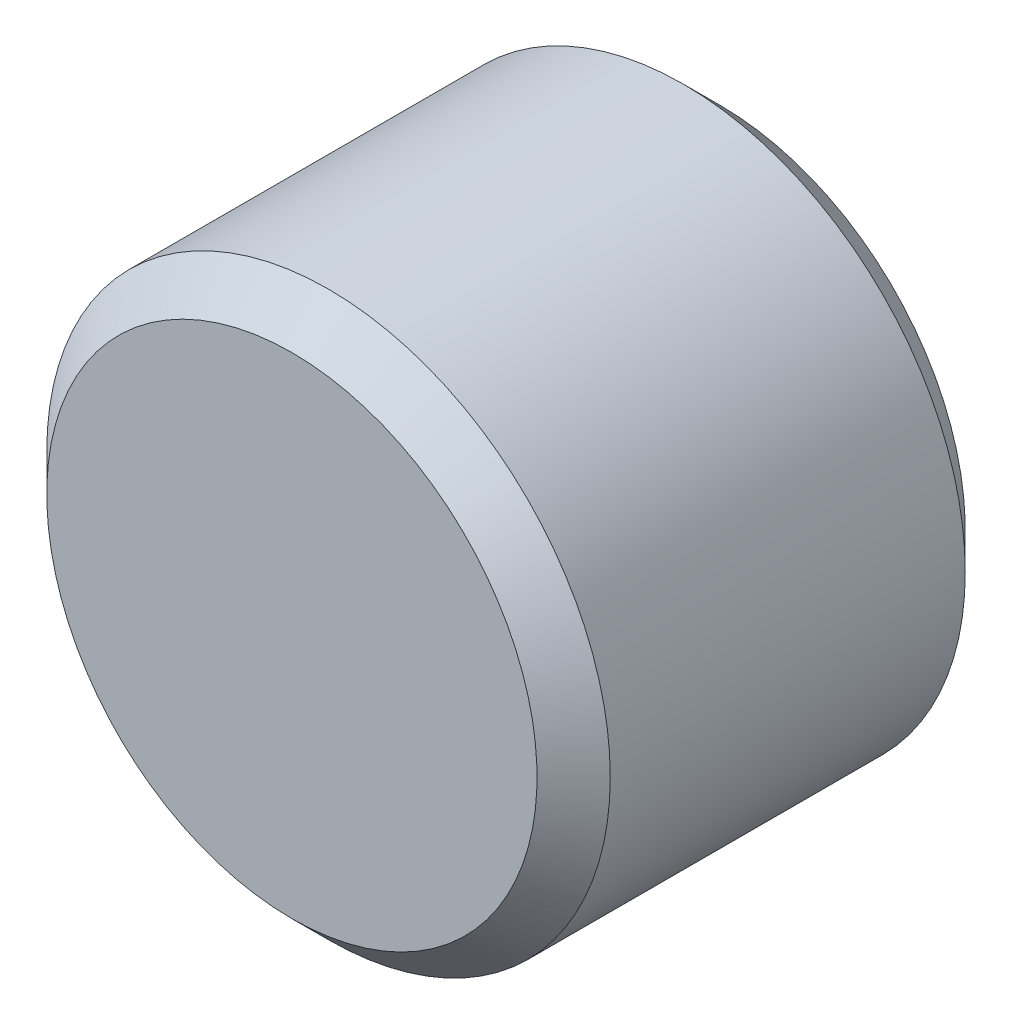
ISO-10303-21;
HEADER;
FILE_DESCRIPTION(('STEP AP214'),'2;1');
FILE_NAME('part.step','',(''),(''),'','','');
FILE_SCHEMA(('AUTOMOTIVE_DESIGN { 1 0 10303 214 1 1 1 1 }'));
ENDSEC;
DATA;
#1=APPLICATION_CONTEXT('core data for automotive mechanical design processes');
#2=APPLICATION_PROTOCOL_DEFINITION('international standard','automotive_design',2000,#1);
#3=PRODUCT_CONTEXT('',#1,'mechanical');
#4=PRODUCT('Part','Part','',(#3));
#5=PRODUCT_RELATED_PRODUCT_CATEGORY('part','',(#4));
#6=PRODUCT_DEFINITION_FORMATION('','',#4);
#7=PRODUCT_DEFINITION_CONTEXT('part definition',#1,'design');
#8=PRODUCT_DEFINITION('design','',#6,#7);
#9=PRODUCT_DEFINITION_SHAPE('','',#8);
#10=(LENGTH_UNIT() NAMED_UNIT(*) SI_UNIT(.MILLI.,.METRE.));
#11=(NAMED_UNIT(*) PLANE_ANGLE_UNIT() SI_UNIT($,.RADIAN.));
#12=(NAMED_UNIT(*) SI_UNIT($,.STERADIAN.) SOLID_ANGLE_UNIT());
#13=UNCERTAINTY_MEASURE_WITH_UNIT(LENGTH_MEASURE(1.E-05),#10,'distance_accuracy_value','');
#14=(GEOMETRIC_REPRESENTATION_CONTEXT(3) GLOBAL_UNCERTAINTY_ASSIGNED_CONTEXT((#13)) GLOBAL_UNIT_ASSIGNED_CONTEXT((#10,
#11,#12)) REPRESENTATION_CONTEXT('',''));
#15=CARTESIAN_POINT('',(0.,0.,0.));
#16=DIRECTION('',(0.,0.,1.));
#17=DIRECTION('',(1.,0.,0.));
#18=AXIS2_PLACEMENT_3D('',#15,#16,#17);
#19=CARTESIAN_POINT('',(0.,3.5,0.));
#20=DIRECTION('',(0.,0.,1.));
#21=DIRECTION('',(0.,-1.,0.));
#22=AXIS2_PLACEMENT_3D('',#19,#20,#21);
#23=PLANE('',#22);
#24=CARTESIAN_POINT('',(0.,0.,0.));
#25=DIRECTION('',(0.,0.,1.));
#26=DIRECTION('',(0.,-1.,0.));
#27=AXIS2_PLACEMENT_3D('',#24,#25,#26);
#28=CIRCLE('',#27,5.71500000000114);
#29=CARTESIAN_POINT('',(0.,-5.71500000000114,0.));
#30=VERTEX_POINT('',#29);
#31=EDGE_CURVE('E150',#30,#30,#28,.T.);
#32=ORIENTED_EDGE('',*,*,#31,.F.);
#33=EDGE_LOOP('',(#32));
#34=FACE_BOUND('',#33,.T.);
#35=DIRECTION('',(0.5,-0.866025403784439,0.));
#36=VECTOR('',#35,1.);
#37=CARTESIAN_POINT('',(1.51554445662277,4.375,0.));
#38=LINE('',#37,#36);
#39=CARTESIAN_POINT('',(2.02072594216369,3.5,0.));
#40=VERTEX_POINT('',#39);
#41=CARTESIAN_POINT('',(4.04145188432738,0.,0.));
#42=VERTEX_POINT('',#41);
#43=EDGE_CURVE('E11',#40,#42,#38,.T.);
#44=ORIENTED_EDGE('',*,*,#43,.F.);
#45=DIRECTION('',(1.,0.,0.));
#46=VECTOR('',#45,1.);
#47=CARTESIAN_POINT('',(0.,3.5,0.));
#48=LINE('',#47,#46);
#49=CARTESIAN_POINT('',(-2.02072594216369,3.5,0.));
#50=VERTEX_POINT('',#49);
#51=EDGE_CURVE('E162',#50,#40,#48,.T.);
#52=ORIENTED_EDGE('',*,*,#51,.F.);
#53=DIRECTION('',(0.5,0.866025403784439,0.));
#54=VECTOR('',#53,1.);
#55=CARTESIAN_POINT('',(-1.51554445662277,4.375,0.));
#56=LINE('',#55,#54);
#57=CARTESIAN_POINT('',(-4.04145188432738,0.,0.));
#58=VERTEX_POINT('',#57);
#59=EDGE_CURVE('E158',#58,#50,#56,.T.);
#60=ORIENTED_EDGE('',*,*,#59,.F.);
#61=DIRECTION('',(-0.5,0.866025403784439,0.));
#62=VECTOR('',#61,1.);
#63=CARTESIAN_POINT('',(-4.54663336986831,0.874999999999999,0.));
#64=LINE('',#63,#62);
#65=CARTESIAN_POINT('',(-2.02072594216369,-3.5,0.));
#66=VERTEX_POINT('',#65);
#67=EDGE_CURVE('E155',#66,#58,#64,.T.);
#68=ORIENTED_EDGE('',*,*,#67,.F.);
#69=DIRECTION('',(-1.,0.,0.));
#70=VECTOR('',#69,1.);
#71=CARTESIAN_POINT('',(0.,-3.5,0.));
#72=LINE('',#71,#70);
#73=CARTESIAN_POINT('',(2.02072594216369,-3.5,0.));
#74=VERTEX_POINT('',#73);
#75=EDGE_CURVE('E160',#74,#66,#72,.T.);
#76=ORIENTED_EDGE('',*,*,#75,.F.);
#77=DIRECTION('',(-0.5,-0.866025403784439,0.));
#78=VECTOR('',#77,1.);
#79=CARTESIAN_POINT('',(4.54663336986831,0.874999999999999,0.));
#80=LINE('',#79,#78);
#81=EDGE_CURVE('E42',#42,#74,#80,.T.);
#82=ORIENTED_EDGE('',*,*,#81,.F.);
#83=EDGE_LOOP('',(#44,#52,#60,#68,#76,#82));
#84=FACE_BOUND('',#83,.T.);
#85=ADVANCED_FACE('F34',(#34,#84),#23,.F.);
#86=CARTESIAN_POINT('',(0.,0.,10.));
#87=DIRECTION('',(0.,0.,-1.));
#88=DIRECTION('',(0.,1.,0.));
#89=AXIS2_PLACEMENT_3D('',#86,#87,#88);
#90=PLANE('',#89);
#91=CARTESIAN_POINT('',(0.,0.,10.));
#92=DIRECTION('',(0.,0.,1.));
#93=DIRECTION('',(0.,-1.,0.));
#94=AXIS2_PLACEMENT_3D('',#91,#92,#93);
#95=CIRCLE('',#94,5.725);
#96=CARTESIAN_POINT('',(0.,-5.725,10.));
#97=VERTEX_POINT('',#96);
#98=EDGE_CURVE('E126',#97,#97,#95,.T.);
#99=ORIENTED_EDGE('',*,*,#98,.T.);
#100=EDGE_LOOP('',(#99));
#101=FACE_BOUND('',#100,.T.);
#102=ADVANCED_FACE('F36',(#101),#90,.F.);
#103=CARTESIAN_POINT('',(0.,0.,10.));
#104=DIRECTION('',(0.,0.,1.));
#105=DIRECTION('',(0.,-1.,0.));
#106=AXIS2_PLACEMENT_3D('',#103,#104,#105);
#107=CYLINDRICAL_SURFACE('',#106,5.71500000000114);
#108=CARTESIAN_POINT('',(0.,0.,9.99000000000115));
#109=DIRECTION('',(0.,0.,1.));
#110=DIRECTION('',(0.,-1.,0.));
#111=AXIS2_PLACEMENT_3D('',#108,#109,#110);
#112=CIRCLE('',#111,5.71500000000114);
#113=CARTESIAN_POINT('',(0.,-5.71500000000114,9.99000000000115));
#114=VERTEX_POINT('',#113);
#115=EDGE_CURVE('E147',#114,#114,#112,.T.);
#116=ORIENTED_EDGE('',*,*,#115,.F.);
#117=EDGE_LOOP('',(#116));
#118=FACE_BOUND('',#117,.T.);
#119=ORIENTED_EDGE('',*,*,#31,.T.);
#120=EDGE_LOOP('',(#119));
#121=FACE_BOUND('',#120,.T.);
#122=ADVANCED_FACE('F245',(#118,#121),#107,.T.);
#123=CARTESIAN_POINT('',(0.,5.72499999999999,9.99000000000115));
#124=DIRECTION('',(0.,0.,1.));
#125=DIRECTION('',(0.,-1.,0.));
#126=AXIS2_PLACEMENT_3D('',#123,#124,#125);
#127=PLANE('',#126);
#128=CARTESIAN_POINT('',(0.,0.,9.99000000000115));
#129=DIRECTION('',(0.,0.,1.));
#130=DIRECTION('',(0.,-1.,0.));
#131=AXIS2_PLACEMENT_3D('',#128,#129,#130);
#132=CIRCLE('',#131,5.72499999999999);
#133=CARTESIAN_POINT('',(0.,-5.72499999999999,9.99000000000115));
#134=VERTEX_POINT('',#133);
#135=EDGE_CURVE('E144',#134,#134,#132,.T.);
#136=ORIENTED_EDGE('',*,*,#135,.F.);
#137=EDGE_LOOP('',(#136));
#138=FACE_BOUND('',#137,.T.);
#139=ORIENTED_EDGE('',*,*,#115,.T.);
#140=EDGE_LOOP('',(#139));
#141=FACE_BOUND('',#140,.T.);
#142=ADVANCED_FACE('F281',(#138,#141),#127,.F.);
#143=CARTESIAN_POINT('',(0.,0.,10.));
#144=DIRECTION('',(0.,0.,1.));
#145=DIRECTION('',(0.,-1.,0.));
#146=AXIS2_PLACEMENT_3D('',#143,#144,#145);
#147=CYLINDRICAL_SURFACE('',#146,5.725);
#148=CARTESIAN_POINT('',(0.,0.,0.));
#149=DIRECTION('',(0.,0.,1.));
#150=DIRECTION('',(0.,-1.,0.));
#151=AXIS2_PLACEMENT_3D('',#148,#149,#150);
#152=CIRCLE('',#151,5.725);
#153=CARTESIAN_POINT('',(0.,-5.725,0.));
#154=VERTEX_POINT('',#153);
#155=EDGE_CURVE('E141',#154,#154,#152,.T.);
#156=ORIENTED_EDGE('',*,*,#155,.F.);
#157=EDGE_LOOP('',(#156));
#158=FACE_BOUND('',#157,.T.);
#159=ORIENTED_EDGE('',*,*,#135,.T.);
#160=EDGE_LOOP('',(#159));
#161=FACE_BOUND('',#160,.T.);
#162=ADVANCED_FACE('F278',(#158,#161),#147,.F.);
#163=CARTESIAN_POINT('',(0.,0.,0.));
#164=DIRECTION('',(0.,0.,1.));
#165=DIRECTION('',(0.,-1.,0.));
#166=AXIS2_PLACEMENT_3D('',#163,#164,#165);
#167=CONICAL_SURFACE('',#166,5.725,0.785398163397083);
#168=CARTESIAN_POINT('',(0.,0.,0.855000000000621));
#169=DIRECTION('',(0.,0.,1.));
#170=DIRECTION('',(0.,-1.,0.));
#171=AXIS2_PLACEMENT_3D('',#168,#169,#170);
#172=CIRCLE('',#171,6.58);
#173=CARTESIAN_POINT('',(0.,-6.58,0.855000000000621));
#174=VERTEX_POINT('',#173);
#175=EDGE_CURVE('E138',#174,#174,#172,.T.);
#176=ORIENTED_EDGE('',*,*,#175,.F.);
#177=EDGE_LOOP('',(#176));
#178=FACE_BOUND('',#177,.T.);
#179=ORIENTED_EDGE('',*,*,#155,.T.);
#180=EDGE_LOOP('',(#179));
#181=FACE_BOUND('',#180,.T.);
#182=ADVANCED_FACE('F274',(#178,#181),#167,.T.);
#183=CARTESIAN_POINT('',(0.,0.,10.));
#184=DIRECTION('',(0.,0.,1.));
#185=DIRECTION('',(0.,-1.,0.));
#186=AXIS2_PLACEMENT_3D('',#183,#184,#185);
#187=CYLINDRICAL_SURFACE('',#186,6.58);
#188=CARTESIAN_POINT('',(0.,0.,9.14500000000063));
#189=DIRECTION('',(0.,0.,1.));
#190=DIRECTION('',(0.,-1.,0.));
#191=AXIS2_PLACEMENT_3D('',#188,#189,#190);
#192=CIRCLE('',#191,6.58);
#193=CARTESIAN_POINT('',(0.,-6.58,9.14500000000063));
#194=VERTEX_POINT('',#193);
#195=EDGE_CURVE('E130',#194,#194,#192,.T.);
#196=ORIENTED_EDGE('',*,*,#195,.F.);
#197=EDGE_LOOP('',(#196));
#198=FACE_BOUND('',#197,.T.);
#199=ORIENTED_EDGE('',*,*,#175,.T.);
#200=EDGE_LOOP('',(#199));
#201=FACE_BOUND('',#200,.T.);
#202=ADVANCED_FACE('F270',(#198,#201),#187,.T.);
#203=CARTESIAN_POINT('',(0.,0.,9.14500000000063));
#204=DIRECTION('',(0.,0.,-1.));
#205=DIRECTION('',(0.,1.,0.));
#206=AXIS2_PLACEMENT_3D('',#203,#204,#205);
#207=CONICAL_SURFACE('',#206,6.58,0.785398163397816);
#208=ORIENTED_EDGE('',*,*,#98,.F.);
#209=EDGE_LOOP('',(#208));
#210=FACE_BOUND('',#209,.T.);
#211=ORIENTED_EDGE('',*,*,#195,.T.);
#212=EDGE_LOOP('',(#211));
#213=FACE_BOUND('',#212,.T.);
#214=ADVANCED_FACE('F267',(#210,#213),#207,.T.);
#215=CARTESIAN_POINT('',(0.,0.,6.));
#216=DIRECTION('',(0.,0.,1.));
#217=DIRECTION('',(1.,0.,0.));
#218=AXIS2_PLACEMENT_3D('',#215,#216,#217);
#219=PLANE('',#218);
#220=DIRECTION('',(0.5,0.866025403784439,0.));
#221=VECTOR('',#220,1.);
#222=CARTESIAN_POINT('',(2.02072594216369,-3.5,6.));
#223=LINE('',#222,#221);
#224=CARTESIAN_POINT('',(2.02072594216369,-3.5,6.));
#225=VERTEX_POINT('',#224);
#226=CARTESIAN_POINT('',(3.03108891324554,-1.75,6.));
#227=VERTEX_POINT('',#226);
#228=EDGE_CURVE('E49',#225,#227,#223,.T.);
#229=ORIENTED_EDGE('',*,*,#228,.F.);
#230=DIRECTION('',(1.,0.,0.));
#231=VECTOR('',#230,1.);
#232=CARTESIAN_POINT('',(-2.02072594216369,-3.5,6.));
#233=LINE('',#232,#231);
#234=CARTESIAN_POINT('',(0.,-3.5,6.));
#235=VERTEX_POINT('',#234);
#236=EDGE_CURVE('E106',#235,#225,#233,.T.);
#237=ORIENTED_EDGE('',*,*,#236,.F.);
#238=CARTESIAN_POINT('',(0.,0.,6.));
#239=DIRECTION('',(0.,0.,1.));
#240=DIRECTION('',(0.,-1.,0.));
#241=AXIS2_PLACEMENT_3D('',#238,#239,#240);
#242=CIRCLE('',#241,3.5);
#243=EDGE_CURVE('E118',#235,#227,#242,.T.);
#244=ORIENTED_EDGE('',*,*,#243,.T.);
#245=EDGE_LOOP('',(#229,#237,#244));
#246=FACE_BOUND('',#245,.T.);
#247=ADVANCED_FACE('F117',(#246),#219,.F.);
#248=CARTESIAN_POINT('',(-2.02072594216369,-3.5,6.));
#249=VERTEX_POINT('',#248);
#250=EDGE_CURVE('E112',#249,#235,#233,.T.);
#251=ORIENTED_EDGE('',*,*,#250,.F.);
#252=DIRECTION('',(0.5,-0.866025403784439,0.));
#253=VECTOR('',#252,1.);
#254=CARTESIAN_POINT('',(-4.04145188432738,0.,6.));
#255=LINE('',#254,#253);
#256=CARTESIAN_POINT('',(-3.03108891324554,-1.75,6.));
#257=VERTEX_POINT('',#256);
#258=EDGE_CURVE('E190',#257,#249,#255,.T.);
#259=ORIENTED_EDGE('',*,*,#258,.F.);
#260=EDGE_CURVE('E153',#257,#235,#242,.T.);
#261=ORIENTED_EDGE('',*,*,#260,.T.);
#262=EDGE_LOOP('',(#251,#259,#261));
#263=FACE_BOUND('',#262,.T.);
#264=ADVANCED_FACE('F227',(#263),#219,.F.);
#265=CARTESIAN_POINT('',(-4.04145188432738,0.,6.));
#266=VERTEX_POINT('',#265);
#267=EDGE_CURVE('E192',#266,#257,#255,.T.);
#268=ORIENTED_EDGE('',*,*,#267,.F.);
#269=DIRECTION('',(-0.5,-0.866025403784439,0.));
#270=VECTOR('',#269,1.);
#271=CARTESIAN_POINT('',(-2.02072594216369,3.5,6.));
#272=LINE('',#271,#270);
#273=CARTESIAN_POINT('',(-3.03108891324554,1.75,6.));
#274=VERTEX_POINT('',#273);
#275=EDGE_CURVE('E201',#274,#266,#272,.T.);
#276=ORIENTED_EDGE('',*,*,#275,.F.);
#277=EDGE_CURVE('E220',#274,#257,#242,.T.);
#278=ORIENTED_EDGE('',*,*,#277,.T.);
#279=EDGE_LOOP('',(#268,#276,#278));
#280=FACE_BOUND('',#279,.T.);
#281=ADVANCED_FACE('F228',(#280),#219,.F.);
#282=CARTESIAN_POINT('',(-2.02072594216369,3.5,6.));
#283=VERTEX_POINT('',#282);
#284=EDGE_CURVE('E198',#283,#274,#272,.T.);
#285=ORIENTED_EDGE('',*,*,#284,.F.);
#286=DIRECTION('',(-1.,0.,0.));
#287=VECTOR('',#286,1.);
#288=CARTESIAN_POINT('',(2.02072594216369,3.5,6.));
#289=LINE('',#288,#287);
#290=CARTESIAN_POINT('',(0.,3.5,6.));
#291=VERTEX_POINT('',#290);
#292=EDGE_CURVE('E204',#291,#283,#289,.T.);
#293=ORIENTED_EDGE('',*,*,#292,.F.);
#294=EDGE_CURVE('E217',#291,#274,#242,.T.);
#295=ORIENTED_EDGE('',*,*,#294,.T.);
#296=EDGE_LOOP('',(#285,#293,#295));
#297=FACE_BOUND('',#296,.T.);
#298=ADVANCED_FACE('F231',(#297),#219,.F.);
#299=CARTESIAN_POINT('',(2.02072594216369,3.5,6.));
#300=VERTEX_POINT('',#299);
#301=EDGE_CURVE('E202',#300,#291,#289,.T.);
#302=ORIENTED_EDGE('',*,*,#301,.F.);
#303=DIRECTION('',(-0.5,0.866025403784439,0.));
#304=VECTOR('',#303,1.);
#305=CARTESIAN_POINT('',(4.04145188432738,0.,6.));
#306=LINE('',#305,#304);
#307=CARTESIAN_POINT('',(3.03108891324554,1.75,6.));
#308=VERTEX_POINT('',#307);
#309=EDGE_CURVE('E120',#308,#300,#306,.T.);
#310=ORIENTED_EDGE('',*,*,#309,.F.);
#311=EDGE_CURVE('E211',#308,#291,#242,.T.);
#312=ORIENTED_EDGE('',*,*,#311,.T.);
#313=EDGE_LOOP('',(#302,#310,#312));
#314=FACE_BOUND('',#313,.T.);
#315=ADVANCED_FACE('F213',(#314),#219,.F.);
#316=CARTESIAN_POINT('',(4.04145188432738,0.,6.));
#317=VERTEX_POINT('',#316);
#318=EDGE_CURVE('E205',#317,#308,#306,.T.);
#319=ORIENTED_EDGE('',*,*,#318,.F.);
#320=EDGE_CURVE('E121',#227,#317,#223,.T.);
#321=ORIENTED_EDGE('',*,*,#320,.F.);
#322=EDGE_CURVE('E156',#227,#308,#242,.T.);
#323=ORIENTED_EDGE('',*,*,#322,.T.);
#324=EDGE_LOOP('',(#319,#321,#323));
#325=FACE_BOUND('',#324,.T.);
#326=ADVANCED_FACE('F209',(#325),#219,.F.);
#327=CARTESIAN_POINT('',(-2.02072594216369,-3.5,6.));
#328=DIRECTION('',(0.,1.,0.));
#329=DIRECTION('',(0.,0.,1.));
#330=AXIS2_PLACEMENT_3D('',#327,#328,#329);
#331=PLANE('',#330);
#332=ORIENTED_EDGE('',*,*,#250,.T.);
#333=ORIENTED_EDGE('',*,*,#236,.T.);
#334=DIRECTION('',(0.,0.,-1.));
#335=VECTOR('',#334,1.);
#336=CARTESIAN_POINT('',(2.02072594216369,-3.5,6.));
#337=LINE('',#336,#335);
#338=EDGE_CURVE('E108',#225,#74,#337,.T.);
#339=ORIENTED_EDGE('',*,*,#338,.T.);
#340=ORIENTED_EDGE('',*,*,#75,.T.);
#341=DIRECTION('',(0.,0.,-1.));
#342=VECTOR('',#341,1.);
#343=CARTESIAN_POINT('',(-2.02072594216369,-3.5,6.));
#344=LINE('',#343,#342);
#345=EDGE_CURVE('E183',#249,#66,#344,.T.);
#346=ORIENTED_EDGE('',*,*,#345,.F.);
#347=EDGE_LOOP('',(#332,#333,#339,#340,#346));
#348=FACE_BOUND('',#347,.T.);
#349=ADVANCED_FACE('F107',(#348),#331,.T.);
#350=CARTESIAN_POINT('',(2.02072594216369,-3.5,6.));
#351=DIRECTION('',(-0.866025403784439,0.5,0.));
#352=DIRECTION('',(-0.5,-0.866025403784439,0.));
#353=AXIS2_PLACEMENT_3D('',#350,#351,#352);
#354=PLANE('',#353);
#355=ORIENTED_EDGE('',*,*,#228,.T.);
#356=ORIENTED_EDGE('',*,*,#320,.T.);
#357=DIRECTION('',(0.,0.,-1.));
#358=VECTOR('',#357,1.);
#359=CARTESIAN_POINT('',(4.04145188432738,0.,6.));
#360=LINE('',#359,#358);
#361=EDGE_CURVE('E127',#317,#42,#360,.T.);
#362=ORIENTED_EDGE('',*,*,#361,.T.);
#363=ORIENTED_EDGE('',*,*,#81,.T.);
#364=ORIENTED_EDGE('',*,*,#338,.F.);
#365=EDGE_LOOP('',(#355,#356,#362,#363,#364));
#366=FACE_BOUND('',#365,.T.);
#367=ADVANCED_FACE('F123',(#366),#354,.T.);
#368=CARTESIAN_POINT('',(4.04145188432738,0.,6.));
#369=DIRECTION('',(-0.866025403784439,-0.5,0.));
#370=DIRECTION('',(0.5,-0.866025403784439,0.));
#371=AXIS2_PLACEMENT_3D('',#368,#369,#370);
#372=PLANE('',#371);
#373=ORIENTED_EDGE('',*,*,#318,.T.);
#374=ORIENTED_EDGE('',*,*,#309,.T.);
#375=DIRECTION('',(0.,0.,-1.));
#376=VECTOR('',#375,1.);
#377=CARTESIAN_POINT('',(2.02072594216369,3.5,6.));
#378=LINE('',#377,#376);
#379=EDGE_CURVE('E132',#300,#40,#378,.T.);
#380=ORIENTED_EDGE('',*,*,#379,.T.);
#381=ORIENTED_EDGE('',*,*,#43,.T.);
#382=ORIENTED_EDGE('',*,*,#361,.F.);
#383=EDGE_LOOP('',(#373,#374,#380,#381,#382));
#384=FACE_BOUND('',#383,.T.);
#385=ADVANCED_FACE('F178',(#384),#372,.T.);
#386=CARTESIAN_POINT('',(2.02072594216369,3.5,6.));
#387=DIRECTION('',(0.,-1.,0.));
#388=DIRECTION('',(0.,0.,-1.));
#389=AXIS2_PLACEMENT_3D('',#386,#387,#388);
#390=PLANE('',#389);
#391=ORIENTED_EDGE('',*,*,#301,.T.);
#392=ORIENTED_EDGE('',*,*,#292,.T.);
#393=DIRECTION('',(0.,0.,-1.));
#394=VECTOR('',#393,1.);
#395=CARTESIAN_POINT('',(-2.02072594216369,3.5,6.));
#396=LINE('',#395,#394);
#397=EDGE_CURVE('E172',#283,#50,#396,.T.);
#398=ORIENTED_EDGE('',*,*,#397,.T.);
#399=ORIENTED_EDGE('',*,*,#51,.T.);
#400=ORIENTED_EDGE('',*,*,#379,.F.);
#401=EDGE_LOOP('',(#391,#392,#398,#399,#400));
#402=FACE_BOUND('',#401,.T.);
#403=ADVANCED_FACE('F169',(#402),#390,.T.);
#404=CARTESIAN_POINT('',(-2.02072594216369,3.5,6.));
#405=DIRECTION('',(0.866025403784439,-0.5,0.));
#406=DIRECTION('',(0.5,0.866025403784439,0.));
#407=AXIS2_PLACEMENT_3D('',#404,#405,#406);
#408=PLANE('',#407);
#409=ORIENTED_EDGE('',*,*,#284,.T.);
#410=ORIENTED_EDGE('',*,*,#275,.T.);
#411=DIRECTION('',(0.,0.,-1.));
#412=VECTOR('',#411,1.);
#413=CARTESIAN_POINT('',(-4.04145188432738,0.,6.));
#414=LINE('',#413,#412);
#415=EDGE_CURVE('E191',#266,#58,#414,.T.);
#416=ORIENTED_EDGE('',*,*,#415,.T.);
#417=ORIENTED_EDGE('',*,*,#59,.T.);
#418=ORIENTED_EDGE('',*,*,#397,.F.);
#419=EDGE_LOOP('',(#409,#410,#416,#417,#418));
#420=FACE_BOUND('',#419,.T.);
#421=ADVANCED_FACE('F230',(#420),#408,.T.);
#422=CARTESIAN_POINT('',(-4.04145188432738,0.,6.));
#423=DIRECTION('',(0.866025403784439,0.5,0.));
#424=DIRECTION('',(-0.5,0.866025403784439,0.));
#425=AXIS2_PLACEMENT_3D('',#422,#423,#424);
#426=PLANE('',#425);
#427=ORIENTED_EDGE('',*,*,#267,.T.);
#428=ORIENTED_EDGE('',*,*,#258,.T.);
#429=ORIENTED_EDGE('',*,*,#345,.T.);
#430=ORIENTED_EDGE('',*,*,#67,.T.);
#431=ORIENTED_EDGE('',*,*,#415,.F.);
#432=EDGE_LOOP('',(#427,#428,#429,#430,#431));
#433=FACE_BOUND('',#432,.T.);
#434=ADVANCED_FACE('F186',(#433),#426,.T.);
#435=CARTESIAN_POINT('',(0.,0.,8.10301216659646));
#436=DIRECTION('',(0.,0.,-1.));
#437=DIRECTION('',(0.,1.,0.));
#438=AXIS2_PLACEMENT_3D('',#435,#436,#437);
#439=CONICAL_SURFACE('',#438,0.,1.02974425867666);
#440=ORIENTED_EDGE('',*,*,#243,.F.);
#441=ORIENTED_EDGE('',*,*,#260,.F.);
#442=ORIENTED_EDGE('',*,*,#277,.F.);
#443=ORIENTED_EDGE('',*,*,#294,.F.);
#444=ORIENTED_EDGE('',*,*,#311,.F.);
#445=ORIENTED_EDGE('',*,*,#322,.F.);
#446=EDGE_LOOP('',(#440,#441,#442,#443,#444,#445));
#447=FACE_BOUND('',#446,.T.);
#448=CARTESIAN_POINT('',(0.,0.,8.10301216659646));
#449=VERTEX_POINT('',#448);
#450=VERTEX_LOOP('',#449);
#451=FACE_BOUND('',#450,.T.);
#452=ADVANCED_FACE('F218',(#447,#451),#439,.F.);
#453=CLOSED_SHELL('',(#85,#102,#122,#142,#162,#182,#202,#214,#247,#264,#281,#298,#315,#326,#349,
#367,#385,#403,#421,#434,#452));
#454=MANIFOLD_SOLID_BREP('B2',#453);
#455=ADVANCED_BREP_SHAPE_REPRESENTATION('',(#18,#454),#14);
#456=SHAPE_DEFINITION_REPRESENTATION(#9,#455);
ENDSEC;
END-ISO-10303-21;
